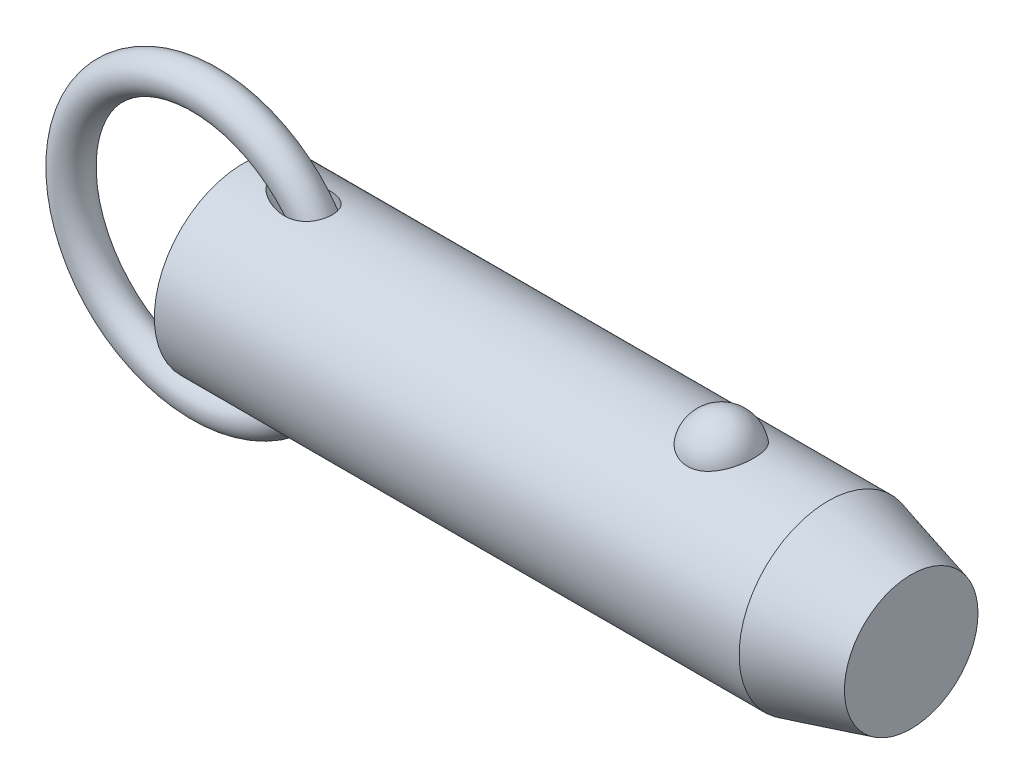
ISO-10303-21;
HEADER;
FILE_DESCRIPTION(('STEP AP214'),'2;1');
FILE_NAME('part.step','',(''),(''),'','','');
FILE_SCHEMA(('AUTOMOTIVE_DESIGN { 1 0 10303 214 1 1 1 1 }'));
ENDSEC;
DATA;
#1=APPLICATION_CONTEXT('core data for automotive mechanical design processes');
#2=APPLICATION_PROTOCOL_DEFINITION('international standard','automotive_design',2000,#1);
#3=PRODUCT_CONTEXT('',#1,'mechanical');
#4=PRODUCT('Part','Part','',(#3));
#5=PRODUCT_RELATED_PRODUCT_CATEGORY('part','',(#4));
#6=PRODUCT_DEFINITION_FORMATION('','',#4);
#7=PRODUCT_DEFINITION_CONTEXT('part definition',#1,'design');
#8=PRODUCT_DEFINITION('design','',#6,#7);
#9=PRODUCT_DEFINITION_SHAPE('','',#8);
#10=(LENGTH_UNIT() NAMED_UNIT(*) SI_UNIT(.MILLI.,.METRE.));
#11=(NAMED_UNIT(*) PLANE_ANGLE_UNIT() SI_UNIT($,.RADIAN.));
#12=(NAMED_UNIT(*) SI_UNIT($,.STERADIAN.) SOLID_ANGLE_UNIT());
#13=UNCERTAINTY_MEASURE_WITH_UNIT(LENGTH_MEASURE(1.E-05),#10,'distance_accuracy_value','');
#14=(GEOMETRIC_REPRESENTATION_CONTEXT(3) GLOBAL_UNCERTAINTY_ASSIGNED_CONTEXT((#13)) GLOBAL_UNIT_ASSIGNED_CONTEXT((#10,
#11,#12)) REPRESENTATION_CONTEXT('',''));
#15=CARTESIAN_POINT('',(0.,0.,0.));
#16=DIRECTION('',(0.,0.,1.));
#17=DIRECTION('',(1.,0.,0.));
#18=AXIS2_PLACEMENT_3D('',#15,#16,#17);
#19=CARTESIAN_POINT('',(-5.53898640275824,0.,0.));
#20=DIRECTION('',(0.,0.,1.));
#21=DIRECTION('',(1.,0.,0.));
#22=AXIS2_PLACEMENT_3D('',#19,#20,#21);
#23=TOROIDAL_SURFACE('',#22,19.05,2.54);
#24=CARTESIAN_POINT('',(16.0510135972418,0.,0.));
#25=VERTEX_POINT('',#24);
#26=VERTEX_LOOP('',#25);
#27=FACE_BOUND('',#26,.T.);
#28=ADVANCED_FACE('P0_F12',(#27),#23,.T.);
#29=CLOSED_SHELL('',(#28));
#30=MANIFOLD_SOLID_BREP('P0_B1',#29);
#31=CARTESIAN_POINT('',(0.,0.,0.));
#32=DIRECTION('',(1.,0.,0.));
#33=DIRECTION('',(0.,0.,-1.));
#34=AXIS2_PLACEMENT_3D('',#31,#32,#33);
#35=CYLINDRICAL_SURFACE('',#34,12.7);
#36=CARTESIAN_POINT('',(83.4007386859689,0.,0.));
#37=DIRECTION('',(1.,0.,0.));
#38=DIRECTION('',(0.,0.,-1.));
#39=AXIS2_PLACEMENT_3D('',#36,#37,#38);
#40=CIRCLE('',#39,12.7);
#41=CARTESIAN_POINT('',(83.4007386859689,0.,-12.7));
#42=VERTEX_POINT('',#41);
#43=EDGE_CURVE('P1_E89',#42,#42,#40,.T.);
#44=ORIENTED_EDGE('',*,*,#43,.F.);
#45=EDGE_LOOP('',(#44));
#46=FACE_BOUND('',#45,.T.);
#47=CARTESIAN_POINT('',(0.,0.,0.));
#48=DIRECTION('',(1.,0.,0.));
#49=DIRECTION('',(0.,0.,-1.));
#50=AXIS2_PLACEMENT_3D('',#47,#48,#49);
#51=CIRCLE('',#50,12.7);
#52=CARTESIAN_POINT('',(0.,0.,-12.7));
#53=VERTEX_POINT('',#52);
#54=EDGE_CURVE('P1_E52',#53,#53,#51,.T.);
#55=ORIENTED_EDGE('',*,*,#54,.T.);
#56=EDGE_LOOP('',(#55));
#57=FACE_BOUND('',#56,.T.);
#58=CARTESIAN_POINT('',(68.1600429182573,11.7500437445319,4.81938502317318));
#59=CARTESIAN_POINT('',(68.0350881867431,11.7500430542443,4.81938571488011));
#60=CARTESIAN_POINT('',(67.910144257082,11.7520975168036,4.81438658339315));
#61=CARTESIAN_POINT('',(67.6611425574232,11.760253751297,4.79442904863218));
#62=CARTESIAN_POINT('',(67.5370850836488,11.7663568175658,4.77946746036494));
#63=CARTESIAN_POINT('',(67.2909016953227,11.7824262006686,4.73971414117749));
#64=CARTESIAN_POINT('',(67.1687744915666,11.7923898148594,4.71492928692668));
#65=CARTESIAN_POINT('',(66.9271874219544,11.8158938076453,4.65571340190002));
#66=CARTESIAN_POINT('',(66.8077285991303,11.8294355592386,4.6212786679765));
#67=CARTESIAN_POINT('',(66.5725578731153,11.8596812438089,4.54309502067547));
#68=CARTESIAN_POINT('',(66.4568393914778,11.8763792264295,4.49936361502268));
#69=CARTESIAN_POINT('',(66.2296530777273,11.9124878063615,4.40287235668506));
#70=CARTESIAN_POINT('',(66.1181868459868,11.9318994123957,4.35010914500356));
#71=CARTESIAN_POINT('',(65.7912782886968,11.9934256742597,4.17881316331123));
#72=CARTESIAN_POINT('',(65.5831270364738,12.038858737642,4.04720756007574));
#73=CARTESIAN_POINT('',(65.1858509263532,12.1352173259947,3.748564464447));
#74=CARTESIAN_POINT('',(64.9974438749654,12.1862630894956,3.58061821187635));
#75=CARTESIAN_POINT('',(64.6505213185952,12.2875163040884,3.21600758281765));
#76=CARTESIAN_POINT('',(64.4920113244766,12.3377235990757,3.0193379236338));
#77=CARTESIAN_POINT('',(64.2016887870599,12.4344923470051,2.592916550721));
#78=CARTESIAN_POINT('',(64.0713762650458,12.4807925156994,2.36208286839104));
#79=CARTESIAN_POINT('',(63.8494079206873,12.5623454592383,1.88070399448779));
#80=CARTESIAN_POINT('',(63.7577554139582,12.5975972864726,1.63015711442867));
#81=CARTESIAN_POINT('',(63.6140466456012,12.6538414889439,1.11298869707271));
#82=CARTESIAN_POINT('',(63.5624990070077,12.6746503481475,0.84620552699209));
#83=CARTESIAN_POINT('',(63.5019771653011,12.699153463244,0.307085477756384));
#84=CARTESIAN_POINT('',(63.4930018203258,12.7028481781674,0.0347487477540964));
#85=CARTESIAN_POINT('',(63.5177310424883,12.6927785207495,-0.506073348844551));
#86=CARTESIAN_POINT('',(63.5511899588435,12.6791146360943,-0.774571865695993));
#87=CARTESIAN_POINT('',(63.6596877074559,12.635882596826,-1.30170246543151));
#88=CARTESIAN_POINT('',(63.7347272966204,12.606314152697,-1.5603343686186));
#89=CARTESIAN_POINT('',(63.9250000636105,12.5342328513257,-2.06083899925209));
#90=CARTESIAN_POINT('',(64.0402872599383,12.4917026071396,-2.3026886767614));
#91=CARTESIAN_POINT('',(64.3087044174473,12.3981123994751,-2.76259600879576));
#92=CARTESIAN_POINT('',(64.4618374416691,12.3470517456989,-2.98065173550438));
#93=CARTESIAN_POINT('',(64.8035077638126,12.2416045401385,-3.38786328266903));
#94=CARTESIAN_POINT('',(64.9922017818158,12.1872040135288,-3.57688418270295));
#95=CARTESIAN_POINT('',(65.4002392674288,12.0814086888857,-3.91941073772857));
#96=CARTESIAN_POINT('',(65.6195800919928,12.0300136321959,-4.07291945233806));
#97=CARTESIAN_POINT('',(66.078375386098,11.9373542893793,-4.33691289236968));
#98=CARTESIAN_POINT('',(66.3173044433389,11.8958982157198,-4.44824125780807));
#99=CARTESIAN_POINT('',(66.8124376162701,11.8268116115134,-4.62881985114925));
#100=CARTESIAN_POINT('',(67.0686351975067,11.7991758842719,-4.69808589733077));
#101=CARTESIAN_POINT('',(67.5771640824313,11.7622209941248,-4.78983181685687));
#102=CARTESIAN_POINT('',(67.8290414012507,11.7520502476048,-4.81449025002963));
#103=CARTESIAN_POINT('',(68.3335734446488,11.7485796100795,-4.82295735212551));
#104=CARTESIAN_POINT('',(68.5862280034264,11.7552763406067,-4.80677420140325));
#105=CARTESIAN_POINT('',(69.0768341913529,11.7842584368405,-4.73525430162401));
#106=CARTESIAN_POINT('',(69.3149984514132,11.8060486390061,-4.68116061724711));
#107=CARTESIAN_POINT('',(69.7784894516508,11.8622750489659,-4.53678133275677));
#108=CARTESIAN_POINT('',(70.0038151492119,11.8967122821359,-4.44649279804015));
#109=CARTESIAN_POINT('',(70.4408018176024,11.9754603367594,-4.2298761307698));
#110=CARTESIAN_POINT('',(70.6520579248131,12.0199699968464,-4.10280539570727));
#111=CARTESIAN_POINT('',(71.0506012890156,12.1138028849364,-3.81685409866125));
#112=CARTESIAN_POINT('',(71.2378830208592,12.163127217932,-3.65796622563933));
#113=CARTESIAN_POINT('',(71.5933509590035,12.2642343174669,-3.30364864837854));
#114=CARTESIAN_POINT('',(71.7601119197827,12.3160165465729,-3.10678783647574));
#115=CARTESIAN_POINT('',(72.0595799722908,12.4142566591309,-2.68748409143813));
#116=CARTESIAN_POINT('',(72.1922809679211,12.4607135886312,-2.46503658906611));
#117=CARTESIAN_POINT('',(72.4246912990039,12.5450236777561,-1.99289519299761));
#118=CARTESIAN_POINT('',(72.523215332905,12.5825557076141,-1.7425591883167));
#119=CARTESIAN_POINT('',(72.6792277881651,12.6431720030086,-1.22773734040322));
#120=CARTESIAN_POINT('',(72.7367157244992,12.6662560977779,-0.963251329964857));
#121=CARTESIAN_POINT('',(72.8095441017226,12.6956486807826,-0.427355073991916));
#122=CARTESIAN_POINT('',(72.8248378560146,12.7019385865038,-0.155937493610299));
#123=CARTESIAN_POINT('',(72.8127794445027,12.6970201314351,0.385928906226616));
#124=CARTESIAN_POINT('',(72.7854280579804,12.6858120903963,0.656377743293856));
#125=CARTESIAN_POINT('',(72.7130609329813,12.6568455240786,1.05454017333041));
#126=CARTESIAN_POINT('',(72.6837963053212,12.6451962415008,1.18577850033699));
#127=CARTESIAN_POINT('',(72.6150228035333,12.6181819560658,1.44513808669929));
#128=CARTESIAN_POINT('',(72.5755176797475,12.6028183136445,1.57326046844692));
#129=CARTESIAN_POINT('',(72.4864397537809,12.5687547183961,1.82554978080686));
#130=CARTESIAN_POINT('',(72.4368627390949,12.5500533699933,1.9497150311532));
#131=CARTESIAN_POINT('',(72.3279211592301,12.5098093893,2.19314370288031));
#132=CARTESIAN_POINT('',(72.2685601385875,12.4882677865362,2.31240887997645));
#133=CARTESIAN_POINT('',(72.1399712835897,12.4427679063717,2.54593031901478));
#134=CARTESIAN_POINT('',(72.0706888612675,12.4187964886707,2.66015396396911));
#135=CARTESIAN_POINT('',(71.922903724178,12.3691892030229,2.88202659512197));
#136=CARTESIAN_POINT('',(71.8444044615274,12.3435539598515,2.98967802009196));
#137=CARTESIAN_POINT('',(71.6785502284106,12.2912955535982,3.19774385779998));
#138=CARTESIAN_POINT('',(71.5911918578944,12.2646720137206,3.29815546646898));
#139=CARTESIAN_POINT('',(71.4081617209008,12.2111945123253,3.49095035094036));
#140=CARTESIAN_POINT('',(71.3124932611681,12.1843406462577,3.58333679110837));
#141=CARTESIAN_POINT('',(71.1136272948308,12.1312249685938,3.75922876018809));
#142=CARTESIAN_POINT('',(71.0104503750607,12.104961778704,3.84275713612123));
#143=CARTESIAN_POINT('',(70.7970133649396,12.0537284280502,4.00056406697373));
#144=CARTESIAN_POINT('',(70.6867562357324,12.028757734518,4.07484645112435));
#145=CARTESIAN_POINT('',(70.4597550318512,11.9808306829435,4.21367959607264));
#146=CARTESIAN_POINT('',(70.3430068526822,11.9578756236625,4.27822410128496));
#147=CARTESIAN_POINT('',(70.1039425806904,11.9147184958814,4.39698483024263));
#148=CARTESIAN_POINT('',(69.9816287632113,11.894515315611,4.45120522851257));
#149=CARTESIAN_POINT('',(69.722952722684,11.8561129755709,4.55255353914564));
#150=CARTESIAN_POINT('',(69.5862237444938,11.8381764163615,4.59884858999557));
#151=CARTESIAN_POINT('',(69.3086087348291,11.8069093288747,4.67853897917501));
#152=CARTESIAN_POINT('',(69.1677245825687,11.7935767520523,4.71194005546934));
#153=CARTESIAN_POINT('',(68.8830944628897,11.7720277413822,4.76552188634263));
#154=CARTESIAN_POINT('',(68.7393488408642,11.7638106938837,4.78570422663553));
#155=CARTESIAN_POINT('',(68.4504114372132,11.7528195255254,4.81263433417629));
#156=CARTESIAN_POINT('',(68.3052198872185,11.7500445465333,4.81938421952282));
#157=CARTESIAN_POINT('',(68.1600429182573,11.7500437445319,4.81938502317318));
#158=B_SPLINE_CURVE_WITH_KNOTS('',3,(#58,#59,#60,#61,#62,#63,#64,#65,#66,#67,#68,#69,#70,#71,
#72,#73,#74,#75,#76,#77,#78,#79,#80,#81,#82,#83,#84,#85,#86,#87,#88,#89,#90,#91,#92,#93,#94,#95,
#96,#97,#98,#99,#100,#101,#102,#103,#104,#105,#106,#107,#108,#109,#110,#111,#112,#113,#114,#115,
#116,#117,#118,#119,#120,#121,#122,#123,#124,#125,#126,#127,#128,#129,#130,#131,#132,#133,#134,
#135,#136,#137,#138,#139,#140,#141,#142,#143,#144,#145,#146,#147,#148,#149,#150,#151,#152,#153,
#154,#155,#156,#157),.UNSPECIFIED.,.T.,.F.,(4,2,2,2,2,2,2,2,2,2,2,2,2,2,2,2,2,2,2,2,2,2,2,2,2,2,
2,2,2,2,2,2,2,2,2,2,2,2,2,2,2,2,2,2,2,2,2,2,2,4),(0.,0.374729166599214,0.749578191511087,
1.12416526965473,1.49889629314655,1.87292776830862,2.24709865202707,2.99481328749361,
3.76399449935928,4.53331735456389,5.3368391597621,6.14042986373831,6.95405296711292,
7.76765424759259,8.57656703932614,9.38549455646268,10.1955119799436,11.0055949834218,
11.8193353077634,12.6330054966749,13.4294141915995,14.2255231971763,14.9815786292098,
15.7374826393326,16.4696948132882,17.2019663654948,17.9501979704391,18.6986017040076,
19.4844704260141,20.2704797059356,21.0815215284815,21.8925729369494,22.7045213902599,
23.5164550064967,23.9209608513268,24.3253187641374,24.7298461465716,25.1342272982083,
25.54092555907,25.9474719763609,26.3541750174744,26.7607169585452,27.1661834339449,
27.5714814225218,27.9770386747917,28.3824315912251,28.8181206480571,29.2536155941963,
29.6890582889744,30.1244323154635),.UNSPECIFIED.);
#159=CARTESIAN_POINT('',(68.1600429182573,11.7500437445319,4.81938502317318));
#160=VERTEX_POINT('',#159);
#161=EDGE_CURVE('P1_E80',#160,#160,#158,.T.);
#162=ORIENTED_EDGE('',*,*,#161,.T.);
#163=EDGE_LOOP('',(#162));
#164=FACE_BOUND('',#163,.T.);
#165=CARTESIAN_POINT('',(-5.53898640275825,0.,0.));
#166=DIRECTION('',(0.796400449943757,-0.604769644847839,0.));
#167=DIRECTION('',(0.604769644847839,0.796400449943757,0.));
#168=AXIS2_PLACEMENT_3D('',#165,#166,#167);
#169=ELLIPSE('',#168,15.9467514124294,12.7);
#170=CARTESIAN_POINT('',(4.0948214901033,12.6864319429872,0.586893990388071));
#171=VERTEX_POINT('',#170);
#172=CARTESIAN_POINT('',(4.0948214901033,12.6864319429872,-0.586893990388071));
#173=VERTEX_POINT('',#172);
#174=EDGE_CURVE('P1_E47',#171,#173,#169,.F.);
#175=ORIENTED_EDGE('',*,*,#174,.T.);
#176=CARTESIAN_POINT('',(4.06153170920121,12.6905758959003,-0.48916605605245));
#177=CARTESIAN_POINT('',(4.08111374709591,12.6881366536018,-0.552489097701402));
#178=CARTESIAN_POINT('',(4.10417851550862,12.6852663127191,-0.614604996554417));
#179=CARTESIAN_POINT('',(4.15628434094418,12.6787965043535,-0.736067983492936));
#180=CARTESIAN_POINT('',(4.18531032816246,12.6751988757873,-0.795421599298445));
#181=CARTESIAN_POINT('',(4.27911159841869,12.6636052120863,-0.967590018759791));
#182=CARTESIAN_POINT('',(4.35123408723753,12.654730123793,-1.07635920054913));
#183=CARTESIAN_POINT('',(4.49106800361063,12.6376715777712,-1.25922957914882));
#184=CARTESIAN_POINT('',(4.55601066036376,12.6297947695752,-1.33556751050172));
#185=CARTESIAN_POINT('',(4.69223626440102,12.6134116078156,-1.4823274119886));
#186=CARTESIAN_POINT('',(4.76352147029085,12.6049050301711,-1.55274725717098));
#187=CARTESIAN_POINT('',(4.91163946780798,12.587417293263,-1.68868704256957));
#188=CARTESIAN_POINT('',(4.98851399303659,12.5784327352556,-1.75416062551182));
#189=CARTESIAN_POINT('',(5.14630057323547,12.560235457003,-1.88003275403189));
#190=CARTESIAN_POINT('',(5.2272139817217,12.5510226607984,-1.94042957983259));
#191=CARTESIAN_POINT('',(5.45368877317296,12.5256514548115,-2.09966332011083));
#192=CARTESIAN_POINT('',(5.60261616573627,12.5094182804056,-2.19371988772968));
#193=CARTESIAN_POINT('',(5.90795545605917,12.4774211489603,-2.36893890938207));
#194=CARTESIAN_POINT('',(6.06437232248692,12.4616575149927,-2.45009264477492));
#195=CARTESIAN_POINT('',(6.38306132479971,12.431227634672,-2.60008249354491));
#196=CARTESIAN_POINT('',(6.54533237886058,12.4165611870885,-2.6689208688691));
#197=CARTESIAN_POINT('',(6.87462618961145,12.3889351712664,-2.79435199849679));
#198=CARTESIAN_POINT('',(7.04164773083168,12.3759751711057,-2.85094785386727));
#199=CARTESIAN_POINT('',(7.38726647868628,12.3518460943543,-2.95377962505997));
#200=CARTESIAN_POINT('',(7.56604577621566,12.3407843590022,-2.99943209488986));
#201=CARTESIAN_POINT('',(7.92698692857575,12.3219309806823,-3.07596683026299));
#202=CARTESIAN_POINT('',(8.10914972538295,12.314140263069,-3.10684491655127));
#203=CARTESIAN_POINT('',(8.47511457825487,12.3025918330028,-3.15226850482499));
#204=CARTESIAN_POINT('',(8.65890979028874,12.2988216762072,-3.16686440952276));
#205=CARTESIAN_POINT('',(9.02696087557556,12.2959421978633,-3.17802250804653));
#206=CARTESIAN_POINT('',(9.2112162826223,12.2968292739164,-3.17459864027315));
#207=CARTESIAN_POINT('',(9.61636263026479,12.3045198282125,-3.14471110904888));
#208=CARTESIAN_POINT('',(9.8369555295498,12.3125080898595,-3.11363232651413));
#209=CARTESIAN_POINT('',(10.1619126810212,12.3303028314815,-3.04206574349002));
#210=CARTESIAN_POINT('',(10.2692747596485,12.3372061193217,-3.01403983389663));
#211=CARTESIAN_POINT('',(10.4811758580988,12.3528538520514,-2.94925947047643));
#212=CARTESIAN_POINT('',(10.5857162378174,12.361597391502,-2.91250930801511));
#213=CARTESIAN_POINT('',(10.792132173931,12.3808585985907,-2.82951748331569));
#214=CARTESIAN_POINT('',(10.8939665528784,12.3913944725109,-2.78317723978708));
#215=CARTESIAN_POINT('',(11.092611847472,12.4138762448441,-2.68112002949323));
#216=CARTESIAN_POINT('',(11.1894254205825,12.4258213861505,-2.62540809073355));
#217=CARTESIAN_POINT('',(11.3768740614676,12.4507225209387,-2.50465655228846));
#218=CARTESIAN_POINT('',(11.4675115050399,12.4636781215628,-2.43962056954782));
#219=CARTESIAN_POINT('',(11.6414572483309,12.4901070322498,-2.30048560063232));
#220=CARTESIAN_POINT('',(11.7247669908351,12.5035802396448,-2.22638840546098));
#221=CARTESIAN_POINT('',(11.8713131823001,12.5285000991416,-2.08117367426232));
#222=CARTESIAN_POINT('',(11.9357009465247,12.5399538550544,-2.01121596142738));
#223=CARTESIAN_POINT('',(12.0576805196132,12.5624496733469,-1.86555293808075));
#224=CARTESIAN_POINT('',(12.1152732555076,12.5734917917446,-1.78984841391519));
#225=CARTESIAN_POINT('',(12.223073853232,12.5947858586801,-1.63327883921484));
#226=CARTESIAN_POINT('',(12.2732844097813,12.6050380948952,-1.55241568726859));
#227=CARTESIAN_POINT('',(12.3658430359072,12.6243983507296,-1.38621267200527));
#228=CARTESIAN_POINT('',(12.4081916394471,12.6335064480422,-1.30087311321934));
#229=CARTESIAN_POINT('',(12.5150098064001,12.6569076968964,-1.05702619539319));
#230=CARTESIAN_POINT('',(12.5703399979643,12.6695746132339,-0.894232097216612));
#231=CARTESIAN_POINT('',(12.6526225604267,12.6886816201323,-0.561391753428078));
#232=CARTESIAN_POINT('',(12.6795825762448,12.6951233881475,-0.391347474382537));
#233=CARTESIAN_POINT('',(12.7041016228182,12.7009766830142,-0.0537636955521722));
#234=CARTESIAN_POINT('',(12.7024538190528,12.7005778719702,0.113714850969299));
#235=CARTESIAN_POINT('',(12.6717240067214,12.6932548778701,0.445979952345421));
#236=CARTESIAN_POINT('',(12.6426435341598,12.6863310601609,0.610766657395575));
#237=CARTESIAN_POINT('',(12.5579769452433,12.6667465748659,0.932429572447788));
#238=CARTESIAN_POINT('',(12.5024793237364,12.6541050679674,1.08933027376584));
#239=CARTESIAN_POINT('',(12.3665691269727,12.6244558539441,1.39146752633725));
#240=CARTESIAN_POINT('',(12.2861577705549,12.6074483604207,1.53670464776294));
#241=CARTESIAN_POINT('',(12.1018203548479,12.5706804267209,1.81319588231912));
#242=CARTESIAN_POINT('',(11.9976588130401,12.5508932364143,1.94428915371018));
#243=CARTESIAN_POINT('',(11.7695265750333,12.5107540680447,2.18776051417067));
#244=CARTESIAN_POINT('',(11.6455540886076,12.4904020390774,2.30013691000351));
#245=CARTESIAN_POINT('',(11.3759347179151,12.4502278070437,2.50870972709));
#246=CARTESIAN_POINT('',(11.2295880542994,12.4304654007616,2.60400962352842));
#247=CARTESIAN_POINT('',(10.9239803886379,12.3941696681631,2.77162929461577));
#248=CARTESIAN_POINT('',(10.7647152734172,12.3776373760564,2.84394171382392));
#249=CARTESIAN_POINT('',(10.4192039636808,12.3473062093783,2.97303525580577));
#250=CARTESIAN_POINT('',(10.2319332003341,12.3340204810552,3.027171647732));
#251=CARTESIAN_POINT('',(9.85152982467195,12.3134301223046,3.10986173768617));
#252=CARTESIAN_POINT('',(9.65839336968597,12.3061295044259,3.13839827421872));
#253=CARTESIAN_POINT('',(9.31022514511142,12.2982822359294,3.16897517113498));
#254=CARTESIAN_POINT('',(9.15555718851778,12.2966525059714,3.17526894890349));
#255=CARTESIAN_POINT('',(8.8461894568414,12.2967963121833,3.17471335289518));
#256=CARTESIAN_POINT('',(8.69148970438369,12.2985715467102,3.16785742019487));
#257=CARTESIAN_POINT('',(8.38280471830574,12.3051648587,3.14214692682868));
#258=CARTESIAN_POINT('',(8.22882218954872,12.3099904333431,3.12326280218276));
#259=CARTESIAN_POINT('',(7.92276070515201,12.3222644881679,3.07448013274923));
#260=CARTESIAN_POINT('',(7.77068148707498,12.3297126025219,3.04458312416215));
#261=CARTESIAN_POINT('',(7.46452663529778,12.3470493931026,2.97350781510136));
#262=CARTESIAN_POINT('',(7.31052714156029,12.3570043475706,2.93201910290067));
#263=CARTESIAN_POINT('',(7.00579083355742,12.3787609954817,2.83876185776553));
#264=CARTESIAN_POINT('',(6.85505451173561,12.3905629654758,2.7869917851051));
#265=CARTESIAN_POINT('',(6.55781208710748,12.415528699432,2.67357744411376));
#266=CARTESIAN_POINT('',(6.41129783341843,12.4286895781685,2.61195394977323));
#267=CARTESIAN_POINT('',(6.12302950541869,12.4559398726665,2.47874512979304));
#268=CARTESIAN_POINT('',(5.98127390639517,12.4700289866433,2.40716303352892));
#269=CARTESIAN_POINT('',(5.67073126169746,12.5020754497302,2.2355042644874));
#270=CARTESIAN_POINT('',(5.50343839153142,12.5201625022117,2.13268685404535));
#271=CARTESIAN_POINT('',(5.26147616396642,12.5471537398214,1.96522579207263));
#272=CARTESIAN_POINT('',(5.18224299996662,12.5561365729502,1.90713440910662));
#273=CARTESIAN_POINT('',(5.0274647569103,12.573912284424,1.78618989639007));
#274=CARTESIAN_POINT('',(4.95191912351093,12.5827051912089,1.72333748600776));
#275=CARTESIAN_POINT('',(4.81787163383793,12.598469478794,1.60360864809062));
#276=CARTESIAN_POINT('',(4.75865966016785,12.6054958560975,1.54753994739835));
#277=CARTESIAN_POINT('',(4.64406285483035,12.6191906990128,1.43158546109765));
#278=CARTESIAN_POINT('',(4.58867926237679,12.6258590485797,1.37169845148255));
#279=CARTESIAN_POINT('',(4.43014912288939,12.6450546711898,1.18656670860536));
#280=CARTESIAN_POINT('',(4.33372726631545,12.6568788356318,1.05507993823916));
#281=CARTESIAN_POINT('',(4.21252055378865,12.6718304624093,0.848052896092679));
#282=CARTESIAN_POINT('',(4.17660155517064,12.6762773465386,0.779100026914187));
#283=CARTESIAN_POINT('',(4.11264979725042,12.6842122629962,0.63708048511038));
#284=CARTESIAN_POINT('',(4.08466792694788,12.6876941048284,0.56399071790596));
#285=CARTESIAN_POINT('',(4.0615317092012,12.6905758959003,0.489166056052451));
#286=B_SPLINE_CURVE_WITH_KNOTS('',3,(#176,#177,#178,#179,#180,#181,#182,#183,#184,#185,#186,
#187,#188,#189,#190,#191,#192,#193,#194,#195,#196,#197,#198,#199,#200,#201,#202,#203,#204,#205,
#206,#207,#208,#209,#210,#211,#212,#213,#214,#215,#216,#217,#218,#219,#220,#221,#222,#223,#224,
#225,#226,#227,#228,#229,#230,#231,#232,#233,#234,#235,#236,#237,#238,#239,#240,#241,#242,#243,
#244,#245,#246,#247,#248,#249,#250,#251,#252,#253,#254,#255,#256,#257,#258,#259,#260,#261,#262,
#263,#264,#265,#266,#267,#268,#269,#270,#271,#272,#273,#274,#275,#276,#277,#278,#279,#280,#281,
#282,#283,#284,#285),.UNSPECIFIED.,.F.,.F.,(4,2,2,2,2,2,2,2,2,2,2,2,2,2,2,2,2,2,2,2,2,2,2,2,2,2,
2,2,2,2,2,2,2,2,2,2,2,2,2,2,2,2,2,2,2,2,2,2,2,2,2,2,2,2,4),(0.,0.198708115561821,
0.39691995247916,0.787580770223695,1.08882492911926,1.39017679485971,1.69407136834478,
1.9980684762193,2.52793143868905,3.05815092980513,3.58827293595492,4.11826050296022,
4.67218806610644,5.22627222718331,5.77863637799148,6.33057333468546,6.99657211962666,
7.3297741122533,7.66281254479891,7.99946156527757,8.33593054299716,8.67226935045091,
9.00854178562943,9.29544181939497,9.58230266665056,9.86905853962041,10.155794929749,
10.670233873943,11.184534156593,11.6845985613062,12.1846349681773,12.6830079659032,
13.1813565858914,13.6848795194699,14.1884479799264,14.713533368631,15.2387866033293,
15.8228373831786,16.4072794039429,16.8710810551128,17.3351141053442,17.8002921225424,
18.2654052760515,18.7444169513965,19.2235004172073,19.7015868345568,20.1795185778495,
20.7699825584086,21.0658110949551,21.361595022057,21.6069574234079,21.8523988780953,
22.3397467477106,22.5729183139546,22.8075527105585),.UNSPECIFIED.);
#287=EDGE_CURVE('P1_E51',#173,#171,#286,.T.);
#288=ORIENTED_EDGE('',*,*,#287,.T.);
#289=EDGE_LOOP('',(#175,#288));
#290=FACE_BOUND('',#289,.T.);
#291=CARTESIAN_POINT('',(-5.53898640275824,0.,0.));
#292=DIRECTION('',(-0.796400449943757,-0.604769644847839,0.));
#293=DIRECTION('',(0.604769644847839,-0.796400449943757,0.));
#294=AXIS2_PLACEMENT_3D('',#291,#292,#293);
#295=ELLIPSE('',#294,15.9467514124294,12.7);
#296=CARTESIAN_POINT('',(4.09482149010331,-12.6864319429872,0.586893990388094));
#297=VERTEX_POINT('',#296);
#298=CARTESIAN_POINT('',(4.09482149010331,-12.6864319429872,-0.586893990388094));
#299=VERTEX_POINT('',#298);
#300=EDGE_CURVE('P1_E28',#297,#299,#295,.F.);
#301=ORIENTED_EDGE('',*,*,#300,.F.);
#302=CARTESIAN_POINT('',(4.06153170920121,-12.6905758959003,0.489166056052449));
#303=CARTESIAN_POINT('',(4.08111374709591,-12.6881366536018,0.552489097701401));
#304=CARTESIAN_POINT('',(4.10417851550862,-12.6852663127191,0.614604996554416));
#305=CARTESIAN_POINT('',(4.15628434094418,-12.6787965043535,0.736067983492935));
#306=CARTESIAN_POINT('',(4.18531032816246,-12.6751988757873,0.795421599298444));
#307=CARTESIAN_POINT('',(4.27911159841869,-12.6636052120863,0.967590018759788));
#308=CARTESIAN_POINT('',(4.35123408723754,-12.654730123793,1.07635920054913));
#309=CARTESIAN_POINT('',(4.49106800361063,-12.6376715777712,1.25922957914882));
#310=CARTESIAN_POINT('',(4.55601066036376,-12.6297947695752,1.33556751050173));
#311=CARTESIAN_POINT('',(4.69223626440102,-12.6134116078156,1.4823274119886));
#312=CARTESIAN_POINT('',(4.76352147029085,-12.6049050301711,1.55274725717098));
#313=CARTESIAN_POINT('',(4.91163946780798,-12.587417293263,1.68868704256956));
#314=CARTESIAN_POINT('',(4.98851399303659,-12.5784327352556,1.75416062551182));
#315=CARTESIAN_POINT('',(5.14630057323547,-12.560235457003,1.88003275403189));
#316=CARTESIAN_POINT('',(5.2272139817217,-12.5510226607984,1.94042957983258));
#317=CARTESIAN_POINT('',(5.45368877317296,-12.5256514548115,2.09966332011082));
#318=CARTESIAN_POINT('',(5.60261616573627,-12.5094182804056,2.19371988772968));
#319=CARTESIAN_POINT('',(5.90795545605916,-12.4774211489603,2.36893890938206));
#320=CARTESIAN_POINT('',(6.06437232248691,-12.4616575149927,2.45009264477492));
#321=CARTESIAN_POINT('',(6.3830613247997,-12.431227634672,2.6000824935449));
#322=CARTESIAN_POINT('',(6.54533237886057,-12.4165611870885,2.66892086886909));
#323=CARTESIAN_POINT('',(6.87462618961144,-12.3889351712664,2.79435199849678));
#324=CARTESIAN_POINT('',(7.04164773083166,-12.3759751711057,2.85094785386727));
#325=CARTESIAN_POINT('',(7.38726647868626,-12.3518460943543,2.95377962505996));
#326=CARTESIAN_POINT('',(7.56604577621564,-12.3407843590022,2.99943209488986));
#327=CARTESIAN_POINT('',(7.92698692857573,-12.3219309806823,3.07596683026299));
#328=CARTESIAN_POINT('',(8.10914972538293,-12.314140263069,3.10684491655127));
#329=CARTESIAN_POINT('',(8.47511457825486,-12.3025918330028,3.15226850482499));
#330=CARTESIAN_POINT('',(8.65890979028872,-12.2988216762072,3.16686440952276));
#331=CARTESIAN_POINT('',(9.02696087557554,-12.2959421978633,3.17802250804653));
#332=CARTESIAN_POINT('',(9.21121628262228,-12.2968292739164,3.17459864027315));
#333=CARTESIAN_POINT('',(9.61636263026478,-12.3045198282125,3.14471110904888));
#334=CARTESIAN_POINT('',(9.83695552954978,-12.3125080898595,3.11363232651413));
#335=CARTESIAN_POINT('',(10.1619126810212,-12.3303028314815,3.04206574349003));
#336=CARTESIAN_POINT('',(10.2692747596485,-12.3372061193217,3.01403983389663));
#337=CARTESIAN_POINT('',(10.4811758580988,-12.3528538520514,2.94925947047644));
#338=CARTESIAN_POINT('',(10.5857162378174,-12.361597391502,2.91250930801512));
#339=CARTESIAN_POINT('',(10.792132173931,-12.3808585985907,2.8295174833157));
#340=CARTESIAN_POINT('',(10.8939665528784,-12.3913944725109,2.78317723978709));
#341=CARTESIAN_POINT('',(11.092611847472,-12.4138762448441,2.68112002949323));
#342=CARTESIAN_POINT('',(11.1894254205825,-12.4258213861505,2.62540809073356));
#343=CARTESIAN_POINT('',(11.3768740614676,-12.4507225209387,2.50465655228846));
#344=CARTESIAN_POINT('',(11.4675115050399,-12.4636781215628,2.43962056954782));
#345=CARTESIAN_POINT('',(11.6414572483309,-12.4901070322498,2.30048560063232));
#346=CARTESIAN_POINT('',(11.7247669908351,-12.5035802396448,2.22638840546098));
#347=CARTESIAN_POINT('',(11.8713131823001,-12.5285000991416,2.08117367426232));
#348=CARTESIAN_POINT('',(11.9357009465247,-12.5399538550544,2.01121596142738));
#349=CARTESIAN_POINT('',(12.0576805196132,-12.5624496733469,1.86555293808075));
#350=CARTESIAN_POINT('',(12.1152732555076,-12.5734917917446,1.78984841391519));
#351=CARTESIAN_POINT('',(12.223073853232,-12.5947858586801,1.63327883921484));
#352=CARTESIAN_POINT('',(12.2732844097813,-12.6050380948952,1.55241568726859));
#353=CARTESIAN_POINT('',(12.3658430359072,-12.6243983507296,1.38621267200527));
#354=CARTESIAN_POINT('',(12.4081916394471,-12.6335064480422,1.30087311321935));
#355=CARTESIAN_POINT('',(12.5150098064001,-12.6569076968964,1.05702619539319));
#356=CARTESIAN_POINT('',(12.5703399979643,-12.6695746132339,0.894232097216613));
#357=CARTESIAN_POINT('',(12.6526225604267,-12.6886816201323,0.561391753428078));
#358=CARTESIAN_POINT('',(12.6795825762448,-12.6951233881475,0.391347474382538));
#359=CARTESIAN_POINT('',(12.7041016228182,-12.7009766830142,0.0537636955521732));
#360=CARTESIAN_POINT('',(12.7024538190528,-12.7005778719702,-0.113714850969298));
#361=CARTESIAN_POINT('',(12.6717240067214,-12.6932548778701,-0.44597995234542));
#362=CARTESIAN_POINT('',(12.6426435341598,-12.6863310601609,-0.610766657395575));
#363=CARTESIAN_POINT('',(12.5579769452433,-12.6667465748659,-0.932429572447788));
#364=CARTESIAN_POINT('',(12.5024793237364,-12.6541050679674,-1.08933027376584));
#365=CARTESIAN_POINT('',(12.3665691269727,-12.6244558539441,-1.39146752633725));
#366=CARTESIAN_POINT('',(12.2861577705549,-12.6074483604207,-1.53670464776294));
#367=CARTESIAN_POINT('',(12.1018203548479,-12.5706804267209,-1.81319588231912));
#368=CARTESIAN_POINT('',(11.9976588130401,-12.5508932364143,-1.94428915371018));
#369=CARTESIAN_POINT('',(11.7695265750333,-12.5107540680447,-2.18776051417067));
#370=CARTESIAN_POINT('',(11.6455540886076,-12.4904020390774,-2.30013691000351));
#371=CARTESIAN_POINT('',(11.3759347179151,-12.4502278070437,-2.50870972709));
#372=CARTESIAN_POINT('',(11.2295880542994,-12.4304654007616,-2.60400962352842));
#373=CARTESIAN_POINT('',(10.9239803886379,-12.3941696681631,-2.77162929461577));
#374=CARTESIAN_POINT('',(10.7647152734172,-12.3776373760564,-2.84394171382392));
#375=CARTESIAN_POINT('',(10.4192039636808,-12.3473062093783,-2.97303525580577));
#376=CARTESIAN_POINT('',(10.2319332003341,-12.3340204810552,-3.027171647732));
#377=CARTESIAN_POINT('',(9.85152982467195,-12.3134301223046,-3.10986173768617));
#378=CARTESIAN_POINT('',(9.65839336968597,-12.3061295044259,-3.13839827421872));
#379=CARTESIAN_POINT('',(9.31022514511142,-12.2982822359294,-3.16897517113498));
#380=CARTESIAN_POINT('',(9.15555718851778,-12.2966525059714,-3.17526894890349));
#381=CARTESIAN_POINT('',(8.8461894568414,-12.2967963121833,-3.17471335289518));
#382=CARTESIAN_POINT('',(8.69148970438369,-12.2985715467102,-3.16785742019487));
#383=CARTESIAN_POINT('',(8.38280471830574,-12.3051648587,-3.14214692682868));
#384=CARTESIAN_POINT('',(8.22882218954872,-12.3099904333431,-3.12326280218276));
#385=CARTESIAN_POINT('',(7.92276070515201,-12.3222644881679,-3.07448013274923));
#386=CARTESIAN_POINT('',(7.77068148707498,-12.3297126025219,-3.04458312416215));
#387=CARTESIAN_POINT('',(7.46452663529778,-12.3470493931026,-2.97350781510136));
#388=CARTESIAN_POINT('',(7.31052714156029,-12.3570043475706,-2.93201910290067));
#389=CARTESIAN_POINT('',(7.00579083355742,-12.3787609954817,-2.83876185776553));
#390=CARTESIAN_POINT('',(6.85505451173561,-12.3905629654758,-2.7869917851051));
#391=CARTESIAN_POINT('',(6.55781208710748,-12.415528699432,-2.67357744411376));
#392=CARTESIAN_POINT('',(6.41129783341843,-12.4286895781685,-2.61195394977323));
#393=CARTESIAN_POINT('',(6.12302950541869,-12.4559398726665,-2.47874512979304));
#394=CARTESIAN_POINT('',(5.98127390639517,-12.4700289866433,-2.40716303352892));
#395=CARTESIAN_POINT('',(5.67073126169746,-12.5020754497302,-2.2355042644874));
#396=CARTESIAN_POINT('',(5.50343839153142,-12.5201625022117,-2.13268685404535));
#397=CARTESIAN_POINT('',(5.26147616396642,-12.5471537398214,-1.96522579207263));
#398=CARTESIAN_POINT('',(5.18224299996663,-12.5561365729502,-1.90713440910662));
#399=CARTESIAN_POINT('',(5.0274647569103,-12.573912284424,-1.78618989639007));
#400=CARTESIAN_POINT('',(4.95191912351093,-12.5827051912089,-1.72333748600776));
#401=CARTESIAN_POINT('',(4.81787163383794,-12.598469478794,-1.60360864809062));
#402=CARTESIAN_POINT('',(4.75865966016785,-12.6054958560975,-1.54753994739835));
#403=CARTESIAN_POINT('',(4.64406285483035,-12.6191906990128,-1.43158546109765));
#404=CARTESIAN_POINT('',(4.58867926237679,-12.6258590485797,-1.37169845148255));
#405=CARTESIAN_POINT('',(4.43014912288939,-12.6450546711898,-1.18656670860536));
#406=CARTESIAN_POINT('',(4.33372726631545,-12.6568788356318,-1.05507993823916));
#407=CARTESIAN_POINT('',(4.21252055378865,-12.6718304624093,-0.848052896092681));
#408=CARTESIAN_POINT('',(4.17660155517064,-12.6762773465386,-0.779100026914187));
#409=CARTESIAN_POINT('',(4.11264979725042,-12.6842122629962,-0.637080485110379));
#410=CARTESIAN_POINT('',(4.08466792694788,-12.6876941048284,-0.563990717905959));
#411=CARTESIAN_POINT('',(4.06153170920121,-12.6905758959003,-0.48916605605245));
#412=B_SPLINE_CURVE_WITH_KNOTS('',3,(#302,#303,#304,#305,#306,#307,#308,#309,#310,#311,#312,
#313,#314,#315,#316,#317,#318,#319,#320,#321,#322,#323,#324,#325,#326,#327,#328,#329,#330,#331,
#332,#333,#334,#335,#336,#337,#338,#339,#340,#341,#342,#343,#344,#345,#346,#347,#348,#349,#350,
#351,#352,#353,#354,#355,#356,#357,#358,#359,#360,#361,#362,#363,#364,#365,#366,#367,#368,#369,
#370,#371,#372,#373,#374,#375,#376,#377,#378,#379,#380,#381,#382,#383,#384,#385,#386,#387,#388,
#389,#390,#391,#392,#393,#394,#395,#396,#397,#398,#399,#400,#401,#402,#403,#404,#405,#406,#407,
#408,#409,#410,#411),.UNSPECIFIED.,.F.,.F.,(4,2,2,2,2,2,2,2,2,2,2,2,2,2,2,2,2,2,2,2,2,2,2,2,2,2,
2,2,2,2,2,2,2,2,2,2,2,2,2,2,2,2,2,2,2,2,2,2,2,2,2,2,2,2,4),(0.,0.198708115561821,
0.39691995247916,0.787580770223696,1.08882492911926,1.39017679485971,1.69407136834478,
1.9980684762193,2.52793143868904,3.05815092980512,3.58827293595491,4.11826050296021,
4.67218806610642,5.22627222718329,5.77863637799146,6.33057333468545,6.99657211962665,
7.32977411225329,7.6628125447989,7.99946156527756,8.33593054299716,8.67226935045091,
9.00854178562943,9.29544181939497,9.58230266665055,9.86905853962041,10.155794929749,
10.670233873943,11.184534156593,11.6845985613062,12.1846349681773,12.6830079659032,
13.1813565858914,13.6848795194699,14.1884479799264,14.713533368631,15.2387866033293,
15.8228373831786,16.4072794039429,16.8710810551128,17.3351141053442,17.8002921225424,
18.2654052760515,18.7444169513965,19.2235004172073,19.7015868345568,20.1795185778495,
20.7699825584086,21.0658110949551,21.361595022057,21.6069574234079,21.8523988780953,
22.3397467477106,22.5729183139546,22.8075527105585),.UNSPECIFIED.);
#413=EDGE_CURVE('P1_E10',#297,#299,#412,.T.);
#414=ORIENTED_EDGE('',*,*,#413,.T.);
#415=EDGE_LOOP('',(#301,#414));
#416=FACE_BOUND('',#415,.T.);
#417=ADVANCED_FACE('P1_F15',(#46,#57,#164,#290,#416),#35,.T.);
#418=CARTESIAN_POINT('',(0.,0.,0.));
#419=DIRECTION('',(-1.,0.,0.));
#420=DIRECTION('',(0.,0.,1.));
#421=AXIS2_PLACEMENT_3D('',#418,#419,#420);
#422=PLANE('',#421);
#423=ORIENTED_EDGE('',*,*,#54,.F.);
#424=EDGE_LOOP('',(#423));
#425=FACE_BOUND('',#424,.T.);
#426=ADVANCED_FACE('P1_F17',(#425),#422,.T.);
#427=CARTESIAN_POINT('',(95.25,0.,0.));
#428=DIRECTION('',(-1.,0.,0.));
#429=DIRECTION('',(0.,0.,1.));
#430=AXIS2_PLACEMENT_3D('',#427,#428,#429);
#431=CONICAL_SURFACE('',#430,9.52500000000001,0.26179938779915);
#432=ORIENTED_EDGE('',*,*,#43,.T.);
#433=EDGE_LOOP('',(#432));
#434=FACE_BOUND('',#433,.T.);
#435=CARTESIAN_POINT('',(95.25,0.,0.));
#436=DIRECTION('',(1.,0.,0.));
#437=DIRECTION('',(0.,0.,-1.));
#438=AXIS2_PLACEMENT_3D('',#435,#436,#437);
#439=CIRCLE('',#438,9.52500000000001);
#440=CARTESIAN_POINT('',(95.25,0.,-9.52500000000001));
#441=VERTEX_POINT('',#440);
#442=EDGE_CURVE('P1_E86',#441,#441,#439,.T.);
#443=ORIENTED_EDGE('',*,*,#442,.F.);
#444=EDGE_LOOP('',(#443));
#445=FACE_BOUND('',#444,.T.);
#446=ADVANCED_FACE('P1_F105',(#434,#445),#431,.T.);
#447=CARTESIAN_POINT('',(95.25,9.52500000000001,0.));
#448=DIRECTION('',(1.,0.,0.));
#449=DIRECTION('',(0.,0.,-1.));
#450=AXIS2_PLACEMENT_3D('',#447,#448,#449);
#451=PLANE('',#450);
#452=ORIENTED_EDGE('',*,*,#442,.T.);
#453=EDGE_LOOP('',(#452));
#454=FACE_BOUND('',#453,.T.);
#455=ADVANCED_FACE('P1_F78',(#454),#451,.T.);
#456=CARTESIAN_POINT('',(68.1600429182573,11.43,0.));
#457=DIRECTION('',(-1.,0.,0.));
#458=DIRECTION('',(0.,1.,0.));
#459=AXIS2_PLACEMENT_3D('',#456,#457,#458);
#460=SPHERICAL_SURFACE('',#459,4.83);
#461=ORIENTED_EDGE('',*,*,#161,.F.);
#462=EDGE_LOOP('',(#461));
#463=FACE_BOUND('',#462,.T.);
#464=ADVANCED_FACE('P1_F71',(#463),#460,.T.);
#465=CARTESIAN_POINT('',(-5.53898640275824,0.,0.));
#466=DIRECTION('',(0.,0.,1.));
#467=DIRECTION('',(1.,0.,0.));
#468=AXIS2_PLACEMENT_3D('',#465,#466,#467);
#469=TOROIDAL_SURFACE('',#468,19.05,3.175);
#470=CARTESIAN_POINT('',(5.9818753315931,-15.1714285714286,0.));
#471=DIRECTION('',(-0.796400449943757,-0.604769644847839,0.));
#472=DIRECTION('',(0.604769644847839,-0.796400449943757,0.));
#473=AXIS2_PLACEMENT_3D('',#470,#471,#472);
#474=CIRCLE('',#473,3.175);
#475=EDGE_CURVE('P1_E34',#297,#299,#474,.T.);
#476=ORIENTED_EDGE('',*,*,#475,.T.);
#477=ORIENTED_EDGE('',*,*,#413,.F.);
#478=EDGE_LOOP('',(#476,#477));
#479=FACE_BOUND('',#478,.T.);
#480=CARTESIAN_POINT('',(5.9818753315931,15.1714285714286,0.));
#481=DIRECTION('',(0.796400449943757,-0.604769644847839,0.));
#482=DIRECTION('',(0.604769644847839,0.796400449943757,0.));
#483=AXIS2_PLACEMENT_3D('',#480,#481,#482);
#484=CIRCLE('',#483,3.175);
#485=EDGE_CURVE('P1_E41',#171,#173,#484,.T.);
#486=ORIENTED_EDGE('',*,*,#485,.F.);
#487=ORIENTED_EDGE('',*,*,#287,.F.);
#488=EDGE_LOOP('',(#486,#487));
#489=FACE_BOUND('',#488,.T.);
#490=ADVANCED_FACE('P1_F55',(#479,#489),#469,.F.);
#491=CARTESIAN_POINT('',(5.9818753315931,-15.1714285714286,0.));
#492=DIRECTION('',(-0.796400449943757,-0.604769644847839,0.));
#493=DIRECTION('',(0.604769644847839,-0.796400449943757,0.));
#494=AXIS2_PLACEMENT_3D('',#491,#492,#493);
#495=PLANE('',#494);
#496=ORIENTED_EDGE('',*,*,#300,.T.);
#497=ORIENTED_EDGE('',*,*,#475,.F.);
#498=EDGE_LOOP('',(#496,#497));
#499=FACE_BOUND('',#498,.T.);
#500=ADVANCED_FACE('P1_F70',(#499),#495,.F.);
#501=CARTESIAN_POINT('',(5.9818753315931,15.1714285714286,0.));
#502=DIRECTION('',(0.796400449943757,-0.604769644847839,0.));
#503=DIRECTION('',(0.604769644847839,0.796400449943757,0.));
#504=AXIS2_PLACEMENT_3D('',#501,#502,#503);
#505=PLANE('',#504);
#506=ORIENTED_EDGE('',*,*,#485,.T.);
#507=ORIENTED_EDGE('',*,*,#174,.F.);
#508=EDGE_LOOP('',(#506,#507));
#509=FACE_BOUND('',#508,.T.);
#510=ADVANCED_FACE('P1_F48',(#509),#505,.T.);
#511=CLOSED_SHELL('',(#417,#426,#446,#455,#464,#490,#500,#510));
#512=MANIFOLD_SOLID_BREP('P1_B1',#511);
#513=ADVANCED_BREP_SHAPE_REPRESENTATION('',(#18,#30,#512),#14);
#514=SHAPE_DEFINITION_REPRESENTATION(#9,#513);
ENDSEC;
END-ISO-10303-21;
